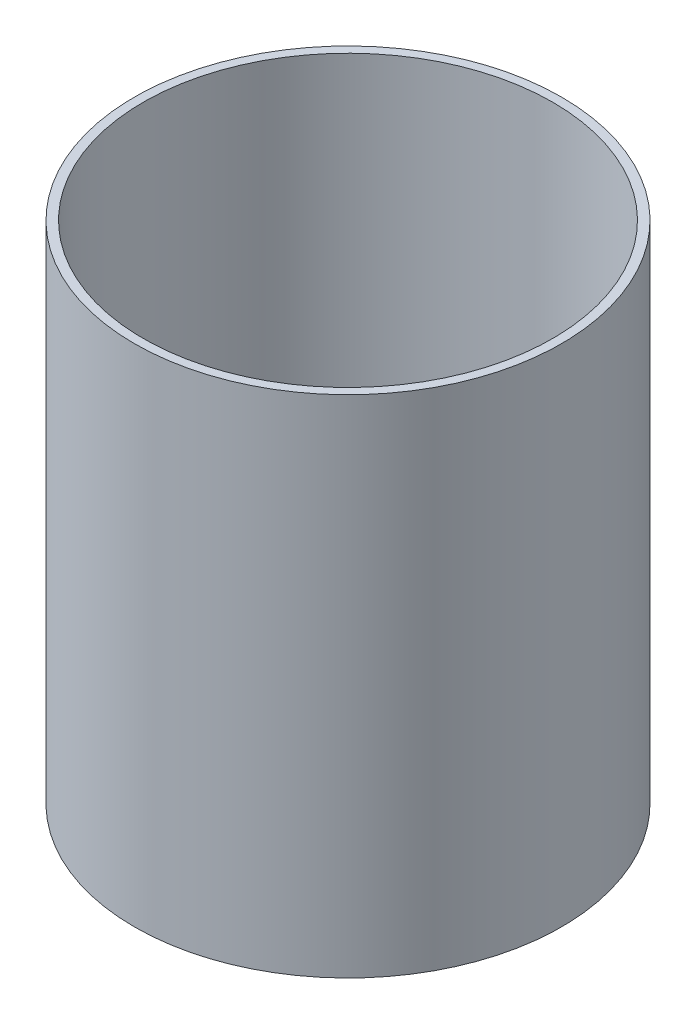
ISO-10303-21;
HEADER;
FILE_DESCRIPTION(('STEP AP214'),'2;1');
FILE_NAME('part.step','',(''),(''),'','','');
FILE_SCHEMA(('AUTOMOTIVE_DESIGN { 1 0 10303 214 1 1 1 1 }'));
ENDSEC;
DATA;
#1=APPLICATION_CONTEXT('core data for automotive mechanical design processes');
#2=APPLICATION_PROTOCOL_DEFINITION('international standard','automotive_design',2000,#1);
#3=PRODUCT_CONTEXT('',#1,'mechanical');
#4=PRODUCT('Part','Part','',(#3));
#5=PRODUCT_RELATED_PRODUCT_CATEGORY('part','',(#4));
#6=PRODUCT_DEFINITION_FORMATION('','',#4);
#7=PRODUCT_DEFINITION_CONTEXT('part definition',#1,'design');
#8=PRODUCT_DEFINITION('design','',#6,#7);
#9=PRODUCT_DEFINITION_SHAPE('','',#8);
#10=(LENGTH_UNIT() NAMED_UNIT(*) SI_UNIT(.MILLI.,.METRE.));
#11=(NAMED_UNIT(*) PLANE_ANGLE_UNIT() SI_UNIT($,.RADIAN.));
#12=(NAMED_UNIT(*) SI_UNIT($,.STERADIAN.) SOLID_ANGLE_UNIT());
#13=UNCERTAINTY_MEASURE_WITH_UNIT(LENGTH_MEASURE(1.E-05),#10,'distance_accuracy_value','');
#14=(GEOMETRIC_REPRESENTATION_CONTEXT(3) GLOBAL_UNCERTAINTY_ASSIGNED_CONTEXT((#13)) GLOBAL_UNIT_ASSIGNED_CONTEXT((#10,
#11,#12)) REPRESENTATION_CONTEXT('',''));
#15=CARTESIAN_POINT('',(0.,0.,0.));
#16=DIRECTION('',(0.,0.,1.));
#17=DIRECTION('',(1.,0.,0.));
#18=AXIS2_PLACEMENT_3D('',#15,#16,#17);
#19=CARTESIAN_POINT('',(0.,57.,0.));
#20=DIRECTION('',(0.,1.,0.));
#21=DIRECTION('',(0.,0.,1.));
#22=AXIS2_PLACEMENT_3D('',#19,#20,#21);
#23=PLANE('',#22);
#24=CARTESIAN_POINT('',(0.,57.,0.));
#25=DIRECTION('',(0.,1.,0.));
#26=DIRECTION('',(0.,0.,1.));
#27=AXIS2_PLACEMENT_3D('',#24,#25,#26);
#28=CIRCLE('',#27,24.1);
#29=CARTESIAN_POINT('',(0.,57.,-24.1));
#30=VERTEX_POINT('',#29);
#31=EDGE_CURVE('E10',#30,#30,#28,.T.);
#32=ORIENTED_EDGE('',*,*,#31,.T.);
#33=EDGE_LOOP('',(#32));
#34=FACE_BOUND('',#33,.T.);
#35=CARTESIAN_POINT('',(0.,57.,0.));
#36=DIRECTION('',(0.,1.,0.));
#37=DIRECTION('',(0.,0.,1.));
#38=AXIS2_PLACEMENT_3D('',#35,#36,#37);
#39=CIRCLE('',#38,23.1);
#40=CARTESIAN_POINT('',(0.,57.,-23.1));
#41=VERTEX_POINT('',#40);
#42=EDGE_CURVE('E35',#41,#41,#39,.T.);
#43=ORIENTED_EDGE('',*,*,#42,.F.);
#44=EDGE_LOOP('',(#43));
#45=FACE_BOUND('',#44,.T.);
#46=ADVANCED_FACE('F24',(#34,#45),#23,.T.);
#47=CARTESIAN_POINT('',(0.,0.,0.));
#48=DIRECTION('',(0.,1.,0.));
#49=DIRECTION('',(0.,0.,1.));
#50=AXIS2_PLACEMENT_3D('',#47,#48,#49);
#51=PLANE('',#50);
#52=CARTESIAN_POINT('',(0.,0.,0.));
#53=DIRECTION('',(0.,1.,0.));
#54=DIRECTION('',(0.,0.,1.));
#55=AXIS2_PLACEMENT_3D('',#52,#53,#54);
#56=CIRCLE('',#55,24.1);
#57=CARTESIAN_POINT('',(0.,0.,-24.1));
#58=VERTEX_POINT('',#57);
#59=EDGE_CURVE('E31',#58,#58,#56,.T.);
#60=ORIENTED_EDGE('',*,*,#59,.F.);
#61=EDGE_LOOP('',(#60));
#62=FACE_BOUND('',#61,.T.);
#63=CARTESIAN_POINT('',(0.,0.,0.));
#64=DIRECTION('',(0.,1.,0.));
#65=DIRECTION('',(0.,0.,1.));
#66=AXIS2_PLACEMENT_3D('',#63,#64,#65);
#67=CIRCLE('',#66,23.1);
#68=CARTESIAN_POINT('',(0.,0.,-23.1));
#69=VERTEX_POINT('',#68);
#70=EDGE_CURVE('E39',#69,#69,#67,.T.);
#71=ORIENTED_EDGE('',*,*,#70,.T.);
#72=EDGE_LOOP('',(#71));
#73=FACE_BOUND('',#72,.T.);
#74=ADVANCED_FACE('F45',(#62,#73),#51,.F.);
#75=CARTESIAN_POINT('',(0.,57.,0.));
#76=DIRECTION('',(0.,-1.,0.));
#77=DIRECTION('',(0.,0.,-1.));
#78=AXIS2_PLACEMENT_3D('',#75,#76,#77);
#79=CYLINDRICAL_SURFACE('',#78,24.1);
#80=CARTESIAN_POINT('',(0.,57.,-24.1));
#81=CARTESIAN_POINT('',(0.,56.40625,-24.1));
#82=CARTESIAN_POINT('',(0.,55.8125,-24.1));
#83=CARTESIAN_POINT('',(0.,54.625,-24.1));
#84=CARTESIAN_POINT('',(0.,54.03125,-24.1));
#85=CARTESIAN_POINT('',(0.,52.84375,-24.1));
#86=CARTESIAN_POINT('',(0.,52.25,-24.1));
#87=CARTESIAN_POINT('',(0.,51.0625,-24.1));
#88=CARTESIAN_POINT('',(0.,50.46875,-24.1));
#89=CARTESIAN_POINT('',(0.,49.28125,-24.1));
#90=CARTESIAN_POINT('',(0.,48.6875,-24.1));
#91=CARTESIAN_POINT('',(0.,47.5,-24.1));
#92=CARTESIAN_POINT('',(0.,46.90625,-24.1));
#93=CARTESIAN_POINT('',(0.,45.71875,-24.1));
#94=CARTESIAN_POINT('',(0.,45.125,-24.1));
#95=CARTESIAN_POINT('',(0.,43.9375,-24.1));
#96=CARTESIAN_POINT('',(0.,43.34375,-24.1));
#97=CARTESIAN_POINT('',(0.,42.15625,-24.1));
#98=CARTESIAN_POINT('',(0.,41.5625,-24.1));
#99=CARTESIAN_POINT('',(0.,40.375,-24.1));
#100=CARTESIAN_POINT('',(0.,39.78125,-24.1));
#101=CARTESIAN_POINT('',(0.,38.59375,-24.1));
#102=CARTESIAN_POINT('',(0.,38.,-24.1));
#103=CARTESIAN_POINT('',(0.,36.8125,-24.1));
#104=CARTESIAN_POINT('',(0.,36.21875,-24.1));
#105=CARTESIAN_POINT('',(0.,35.03125,-24.1));
#106=CARTESIAN_POINT('',(0.,34.4375,-24.1));
#107=CARTESIAN_POINT('',(0.,33.25,-24.1));
#108=CARTESIAN_POINT('',(0.,32.65625,-24.1));
#109=CARTESIAN_POINT('',(0.,31.46875,-24.1));
#110=CARTESIAN_POINT('',(0.,30.875,-24.1));
#111=CARTESIAN_POINT('',(0.,29.6875,-24.1));
#112=CARTESIAN_POINT('',(0.,29.09375,-24.1));
#113=CARTESIAN_POINT('',(0.,27.90625,-24.1));
#114=CARTESIAN_POINT('',(0.,27.3125,-24.1));
#115=CARTESIAN_POINT('',(0.,26.125,-24.1));
#116=CARTESIAN_POINT('',(0.,25.53125,-24.1));
#117=CARTESIAN_POINT('',(0.,24.34375,-24.1));
#118=CARTESIAN_POINT('',(0.,23.75,-24.1));
#119=CARTESIAN_POINT('',(0.,22.5625,-24.1));
#120=CARTESIAN_POINT('',(0.,21.96875,-24.1));
#121=CARTESIAN_POINT('',(0.,20.78125,-24.1));
#122=CARTESIAN_POINT('',(0.,20.1875,-24.1));
#123=CARTESIAN_POINT('',(0.,19.,-24.1));
#124=CARTESIAN_POINT('',(0.,18.40625,-24.1));
#125=CARTESIAN_POINT('',(0.,17.21875,-24.1));
#126=CARTESIAN_POINT('',(0.,16.625,-24.1));
#127=CARTESIAN_POINT('',(0.,15.4375,-24.1));
#128=CARTESIAN_POINT('',(0.,14.84375,-24.1));
#129=CARTESIAN_POINT('',(0.,13.65625,-24.1));
#130=CARTESIAN_POINT('',(0.,13.0625,-24.1));
#131=CARTESIAN_POINT('',(0.,11.875,-24.1));
#132=CARTESIAN_POINT('',(0.,11.28125,-24.1));
#133=CARTESIAN_POINT('',(0.,10.09375,-24.1));
#134=CARTESIAN_POINT('',(0.,9.5,-24.1));
#135=CARTESIAN_POINT('',(0.,8.3125,-24.1));
#136=CARTESIAN_POINT('',(0.,7.71875,-24.1));
#137=CARTESIAN_POINT('',(0.,6.53125,-24.1));
#138=CARTESIAN_POINT('',(0.,5.9375,-24.1));
#139=CARTESIAN_POINT('',(0.,4.75,-24.1));
#140=CARTESIAN_POINT('',(0.,4.15625,-24.1));
#141=CARTESIAN_POINT('',(0.,2.96875,-24.1));
#142=CARTESIAN_POINT('',(0.,2.375,-24.1));
#143=CARTESIAN_POINT('',(0.,1.1875,-24.1));
#144=CARTESIAN_POINT('',(0.,0.593749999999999,-24.1));
#145=CARTESIAN_POINT('',(0.,0.,-24.1));
#146=B_SPLINE_CURVE_WITH_KNOTS('',3,(#80,#81,#82,#83,#84,#85,#86,#87,#88,#89,#90,#91,#92,#93,
#94,#95,#96,#97,#98,#99,#100,#101,#102,#103,#104,#105,#106,#107,#108,#109,#110,#111,#112,#113,
#114,#115,#116,#117,#118,#119,#120,#121,#122,#123,#124,#125,#126,#127,#128,#129,#130,#131,#132,
#133,#134,#135,#136,#137,#138,#139,#140,#141,#142,#143,#144,#145),.UNSPECIFIED.,.F.,.F.,(4,2,2,
2,2,2,2,2,2,2,2,2,2,2,2,2,2,2,2,2,2,2,2,2,2,2,2,2,2,2,2,2,4),(0.,1.78125000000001,3.5625,
5.34375,7.12500000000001,8.90625,10.6875,12.46875,14.25,16.03125,17.8125,19.59375,21.375,
23.15625,24.9375,26.71875,28.5,30.28125,32.0625,33.84375,35.625,37.40625,39.1875,40.96875,42.75,
44.53125,46.3125,48.09375,49.875,51.65625,53.4375,55.21875,57.),.UNSPECIFIED.);
#147=EDGE_CURVE('BSEAM26',#30,#58,#146,.T.);
#148=ORIENTED_EDGE('',*,*,#31,.F.);
#149=ORIENTED_EDGE('',*,*,#59,.T.);
#150=ORIENTED_EDGE('',*,*,#147,.T.);
#151=ORIENTED_EDGE('',*,*,#147,.F.);
#152=EDGE_LOOP('',(#148,#150,#149,#151));
#153=FACE_BOUND('',#152,.T.);
#154=ADVANCED_FACE('F26',(#153),#79,.T.);
#155=CARTESIAN_POINT('',(0.,57.,0.));
#156=DIRECTION('',(0.,-1.,0.));
#157=DIRECTION('',(0.,0.,-1.));
#158=AXIS2_PLACEMENT_3D('',#155,#156,#157);
#159=CYLINDRICAL_SURFACE('',#158,23.1);
#160=CARTESIAN_POINT('',(0.,57.,-23.1));
#161=CARTESIAN_POINT('',(0.,56.40625,-23.1));
#162=CARTESIAN_POINT('',(0.,55.8125,-23.1));
#163=CARTESIAN_POINT('',(0.,54.625,-23.1));
#164=CARTESIAN_POINT('',(0.,54.03125,-23.1));
#165=CARTESIAN_POINT('',(0.,52.84375,-23.1));
#166=CARTESIAN_POINT('',(0.,52.25,-23.1));
#167=CARTESIAN_POINT('',(0.,51.0625,-23.1));
#168=CARTESIAN_POINT('',(0.,50.46875,-23.1));
#169=CARTESIAN_POINT('',(0.,49.28125,-23.1));
#170=CARTESIAN_POINT('',(0.,48.6875,-23.1));
#171=CARTESIAN_POINT('',(0.,47.5,-23.1));
#172=CARTESIAN_POINT('',(0.,46.90625,-23.1));
#173=CARTESIAN_POINT('',(0.,45.71875,-23.1));
#174=CARTESIAN_POINT('',(0.,45.125,-23.1));
#175=CARTESIAN_POINT('',(0.,43.9375,-23.1));
#176=CARTESIAN_POINT('',(0.,43.34375,-23.1));
#177=CARTESIAN_POINT('',(0.,42.15625,-23.1));
#178=CARTESIAN_POINT('',(0.,41.5625,-23.1));
#179=CARTESIAN_POINT('',(0.,40.375,-23.1));
#180=CARTESIAN_POINT('',(0.,39.78125,-23.1));
#181=CARTESIAN_POINT('',(0.,38.59375,-23.1));
#182=CARTESIAN_POINT('',(0.,38.,-23.1));
#183=CARTESIAN_POINT('',(0.,36.8125,-23.1));
#184=CARTESIAN_POINT('',(0.,36.21875,-23.1));
#185=CARTESIAN_POINT('',(0.,35.03125,-23.1));
#186=CARTESIAN_POINT('',(0.,34.4375,-23.1));
#187=CARTESIAN_POINT('',(0.,33.25,-23.1));
#188=CARTESIAN_POINT('',(0.,32.65625,-23.1));
#189=CARTESIAN_POINT('',(0.,31.46875,-23.1));
#190=CARTESIAN_POINT('',(0.,30.875,-23.1));
#191=CARTESIAN_POINT('',(0.,29.6875,-23.1));
#192=CARTESIAN_POINT('',(0.,29.09375,-23.1));
#193=CARTESIAN_POINT('',(0.,27.90625,-23.1));
#194=CARTESIAN_POINT('',(0.,27.3125,-23.1));
#195=CARTESIAN_POINT('',(0.,26.125,-23.1));
#196=CARTESIAN_POINT('',(0.,25.53125,-23.1));
#197=CARTESIAN_POINT('',(0.,24.34375,-23.1));
#198=CARTESIAN_POINT('',(0.,23.75,-23.1));
#199=CARTESIAN_POINT('',(0.,22.5625,-23.1));
#200=CARTESIAN_POINT('',(0.,21.96875,-23.1));
#201=CARTESIAN_POINT('',(0.,20.78125,-23.1));
#202=CARTESIAN_POINT('',(0.,20.1875,-23.1));
#203=CARTESIAN_POINT('',(0.,19.,-23.1));
#204=CARTESIAN_POINT('',(0.,18.40625,-23.1));
#205=CARTESIAN_POINT('',(0.,17.21875,-23.1));
#206=CARTESIAN_POINT('',(0.,16.625,-23.1));
#207=CARTESIAN_POINT('',(0.,15.4375,-23.1));
#208=CARTESIAN_POINT('',(0.,14.84375,-23.1));
#209=CARTESIAN_POINT('',(0.,13.65625,-23.1));
#210=CARTESIAN_POINT('',(0.,13.0625,-23.1));
#211=CARTESIAN_POINT('',(0.,11.875,-23.1));
#212=CARTESIAN_POINT('',(0.,11.28125,-23.1));
#213=CARTESIAN_POINT('',(0.,10.09375,-23.1));
#214=CARTESIAN_POINT('',(0.,9.5,-23.1));
#215=CARTESIAN_POINT('',(0.,8.3125,-23.1));
#216=CARTESIAN_POINT('',(0.,7.71875,-23.1));
#217=CARTESIAN_POINT('',(0.,6.53125,-23.1));
#218=CARTESIAN_POINT('',(0.,5.9375,-23.1));
#219=CARTESIAN_POINT('',(0.,4.75,-23.1));
#220=CARTESIAN_POINT('',(0.,4.15625,-23.1));
#221=CARTESIAN_POINT('',(0.,2.96875,-23.1));
#222=CARTESIAN_POINT('',(0.,2.375,-23.1));
#223=CARTESIAN_POINT('',(0.,1.1875,-23.1));
#224=CARTESIAN_POINT('',(0.,0.593749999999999,-23.1));
#225=CARTESIAN_POINT('',(0.,0.,-23.1));
#226=B_SPLINE_CURVE_WITH_KNOTS('',3,(#160,#161,#162,#163,#164,#165,#166,#167,#168,#169,#170,
#171,#172,#173,#174,#175,#176,#177,#178,#179,#180,#181,#182,#183,#184,#185,#186,#187,#188,#189,
#190,#191,#192,#193,#194,#195,#196,#197,#198,#199,#200,#201,#202,#203,#204,#205,#206,#207,#208,
#209,#210,#211,#212,#213,#214,#215,#216,#217,#218,#219,#220,#221,#222,#223,#224,#225),
.UNSPECIFIED.,.F.,.F.,(4,2,2,2,2,2,2,2,2,2,2,2,2,2,2,2,2,2,2,2,2,2,2,2,2,2,2,2,2,2,2,2,4),(0.,
1.78125000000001,3.5625,5.34375,7.12500000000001,8.90625,10.6875,12.46875,14.25,16.03125,
17.8125,19.59375,21.375,23.15625,24.9375,26.71875,28.5,30.28125,32.0625,33.84375,35.625,
37.40625,39.1875,40.96875,42.75,44.53125,46.3125,48.09375,49.875,51.65625,53.4375,55.21875,57.),.UNSPECIFIED.);
#227=EDGE_CURVE('BSEAM47',#41,#69,#226,.T.);
#228=ORIENTED_EDGE('',*,*,#42,.T.);
#229=ORIENTED_EDGE('',*,*,#70,.F.);
#230=ORIENTED_EDGE('',*,*,#227,.T.);
#231=ORIENTED_EDGE('',*,*,#227,.F.);
#232=EDGE_LOOP('',(#228,#230,#229,#231));
#233=FACE_BOUND('',#232,.T.);
#234=ADVANCED_FACE('F47',(#233),#159,.F.);
#235=CLOSED_SHELL('',(#46,#74,#154,#234));
#236=MANIFOLD_SOLID_BREP('B2',#235);
#237=ADVANCED_BREP_SHAPE_REPRESENTATION('',(#18,#236),#14);
#238=SHAPE_DEFINITION_REPRESENTATION(#9,#237);
ENDSEC;
END-ISO-10303-21;
